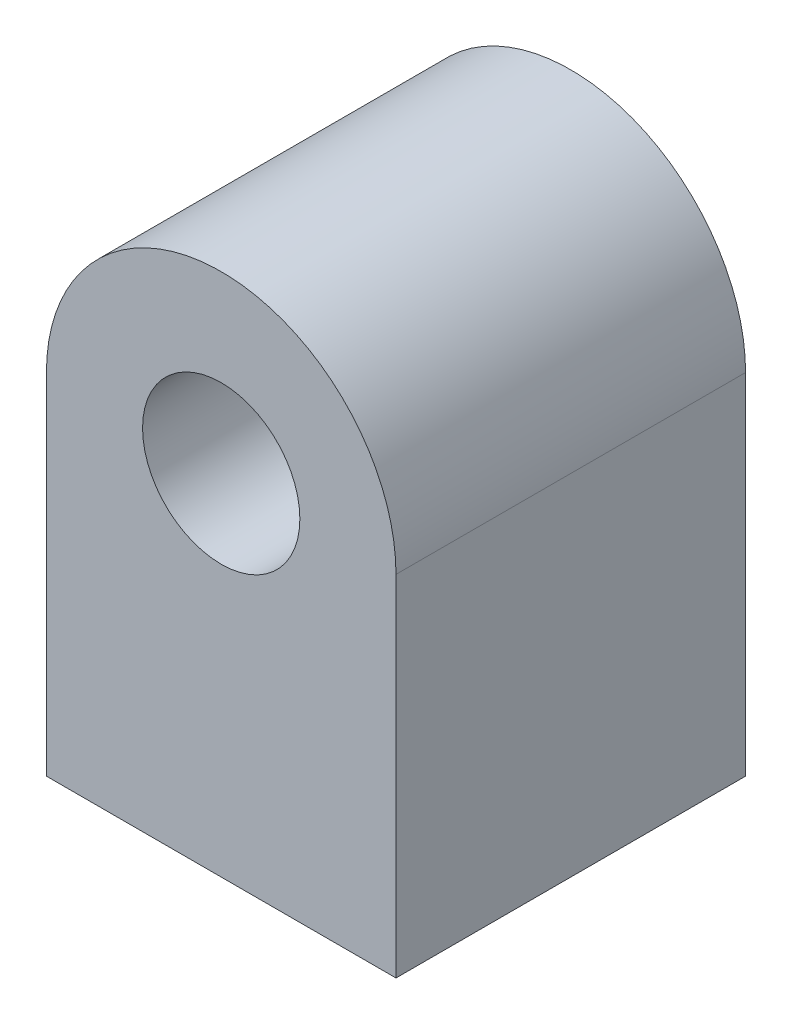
ISO-10303-21;
HEADER;
FILE_DESCRIPTION(('STEP AP214'),'2;1');
FILE_NAME('part.step','',(''),(''),'','','');
FILE_SCHEMA(('AUTOMOTIVE_DESIGN { 1 0 10303 214 1 1 1 1 }'));
ENDSEC;
DATA;
#1=APPLICATION_CONTEXT('core data for automotive mechanical design processes');
#2=APPLICATION_PROTOCOL_DEFINITION('international standard','automotive_design',2000,#1);
#3=PRODUCT_CONTEXT('',#1,'mechanical');
#4=PRODUCT('Part','Part','',(#3));
#5=PRODUCT_RELATED_PRODUCT_CATEGORY('part','',(#4));
#6=PRODUCT_DEFINITION_FORMATION('','',#4);
#7=PRODUCT_DEFINITION_CONTEXT('part definition',#1,'design');
#8=PRODUCT_DEFINITION('design','',#6,#7);
#9=PRODUCT_DEFINITION_SHAPE('','',#8);
#10=(LENGTH_UNIT() NAMED_UNIT(*) SI_UNIT(.MILLI.,.METRE.));
#11=(NAMED_UNIT(*) PLANE_ANGLE_UNIT() SI_UNIT($,.RADIAN.));
#12=(NAMED_UNIT(*) SI_UNIT($,.STERADIAN.) SOLID_ANGLE_UNIT());
#13=UNCERTAINTY_MEASURE_WITH_UNIT(LENGTH_MEASURE(1.E-05),#10,'distance_accuracy_value','');
#14=(GEOMETRIC_REPRESENTATION_CONTEXT(3) GLOBAL_UNCERTAINTY_ASSIGNED_CONTEXT((#13)) GLOBAL_UNIT_ASSIGNED_CONTEXT((#10,
#11,#12)) REPRESENTATION_CONTEXT('',''));
#15=CARTESIAN_POINT('',(0.,0.,0.));
#16=DIRECTION('',(0.,0.,1.));
#17=DIRECTION('',(1.,0.,0.));
#18=AXIS2_PLACEMENT_3D('',#15,#16,#17);
#19=CARTESIAN_POINT('',(0.,0.,20.));
#20=DIRECTION('',(1.,0.,0.));
#21=DIRECTION('',(0.,0.,-1.));
#22=AXIS2_PLACEMENT_3D('',#19,#20,#21);
#23=PLANE('',#22);
#24=DIRECTION('',(0.,-1.,0.));
#25=VECTOR('',#24,1.);
#26=CARTESIAN_POINT('',(0.,0.,0.));
#27=LINE('',#26,#25);
#28=CARTESIAN_POINT('',(0.,20.,0.));
#29=VERTEX_POINT('',#28);
#30=CARTESIAN_POINT('',(0.,0.,0.));
#31=VERTEX_POINT('',#30);
#32=EDGE_CURVE('E71',#29,#31,#27,.T.);
#33=ORIENTED_EDGE('',*,*,#32,.T.);
#34=DIRECTION('',(0.,0.,-1.));
#35=VECTOR('',#34,1.);
#36=CARTESIAN_POINT('',(0.,0.,20.));
#37=LINE('',#36,#35);
#38=CARTESIAN_POINT('',(0.,0.,20.));
#39=VERTEX_POINT('',#38);
#40=EDGE_CURVE('E11',#39,#31,#37,.T.);
#41=ORIENTED_EDGE('',*,*,#40,.F.);
#42=DIRECTION('',(0.,-1.,0.));
#43=VECTOR('',#42,1.);
#44=CARTESIAN_POINT('',(0.,0.,20.));
#45=LINE('',#44,#43);
#46=CARTESIAN_POINT('',(0.,20.,20.));
#47=VERTEX_POINT('',#46);
#48=EDGE_CURVE('E92',#47,#39,#45,.T.);
#49=ORIENTED_EDGE('',*,*,#48,.F.);
#50=DIRECTION('',(0.,0.,-1.));
#51=VECTOR('',#50,1.);
#52=CARTESIAN_POINT('',(0.,20.,20.));
#53=LINE('',#52,#51);
#54=EDGE_CURVE('E83',#47,#29,#53,.T.);
#55=ORIENTED_EDGE('',*,*,#54,.T.);
#56=EDGE_LOOP('',(#33,#41,#49,#55));
#57=FACE_BOUND('',#56,.T.);
#58=ADVANCED_FACE('F26',(#57),#23,.F.);
#59=CARTESIAN_POINT('',(0.,0.,20.));
#60=DIRECTION('',(0.,1.,0.));
#61=DIRECTION('',(0.,0.,1.));
#62=AXIS2_PLACEMENT_3D('',#59,#60,#61);
#63=PLANE('',#62);
#64=DIRECTION('',(1.,0.,0.));
#65=VECTOR('',#64,1.);
#66=CARTESIAN_POINT('',(0.,0.,0.));
#67=LINE('',#66,#65);
#68=CARTESIAN_POINT('',(20.,0.,0.));
#69=VERTEX_POINT('',#68);
#70=EDGE_CURVE('E67',#31,#69,#67,.T.);
#71=ORIENTED_EDGE('',*,*,#70,.T.);
#72=DIRECTION('',(0.,0.,-1.));
#73=VECTOR('',#72,1.);
#74=CARTESIAN_POINT('',(20.,0.,20.));
#75=LINE('',#74,#73);
#76=CARTESIAN_POINT('',(20.,0.,20.));
#77=VERTEX_POINT('',#76);
#78=EDGE_CURVE('E34',#77,#69,#75,.T.);
#79=ORIENTED_EDGE('',*,*,#78,.F.);
#80=DIRECTION('',(1.,0.,0.));
#81=VECTOR('',#80,1.);
#82=CARTESIAN_POINT('',(0.,0.,20.));
#83=LINE('',#82,#81);
#84=EDGE_CURVE('E79',#39,#77,#83,.T.);
#85=ORIENTED_EDGE('',*,*,#84,.F.);
#86=ORIENTED_EDGE('',*,*,#40,.T.);
#87=EDGE_LOOP('',(#71,#79,#85,#86));
#88=FACE_BOUND('',#87,.T.);
#89=ADVANCED_FACE('F78',(#88),#63,.F.);
#90=CARTESIAN_POINT('',(20.,0.,20.));
#91=DIRECTION('',(-1.,0.,0.));
#92=DIRECTION('',(0.,0.,1.));
#93=AXIS2_PLACEMENT_3D('',#90,#91,#92);
#94=PLANE('',#93);
#95=DIRECTION('',(0.,1.,0.));
#96=VECTOR('',#95,1.);
#97=CARTESIAN_POINT('',(20.,0.,0.));
#98=LINE('',#97,#96);
#99=CARTESIAN_POINT('',(20.,20.,0.));
#100=VERTEX_POINT('',#99);
#101=EDGE_CURVE('E72',#69,#100,#98,.T.);
#102=ORIENTED_EDGE('',*,*,#101,.T.);
#103=DIRECTION('',(0.,0.,-1.));
#104=VECTOR('',#103,1.);
#105=CARTESIAN_POINT('',(20.,20.,20.));
#106=LINE('',#105,#104);
#107=CARTESIAN_POINT('',(20.,20.,20.));
#108=VERTEX_POINT('',#107);
#109=EDGE_CURVE('E98',#108,#100,#106,.T.);
#110=ORIENTED_EDGE('',*,*,#109,.F.);
#111=DIRECTION('',(0.,1.,0.));
#112=VECTOR('',#111,1.);
#113=CARTESIAN_POINT('',(20.,0.,20.));
#114=LINE('',#113,#112);
#115=EDGE_CURVE('E46',#77,#108,#114,.T.);
#116=ORIENTED_EDGE('',*,*,#115,.F.);
#117=ORIENTED_EDGE('',*,*,#78,.T.);
#118=EDGE_LOOP('',(#102,#110,#116,#117));
#119=FACE_BOUND('',#118,.T.);
#120=ADVANCED_FACE('F102',(#119),#94,.F.);
#121=CARTESIAN_POINT('',(10.,20.,20.));
#122=DIRECTION('',(0.,0.,-1.));
#123=DIRECTION('',(-1.,0.,0.));
#124=AXIS2_PLACEMENT_3D('',#121,#122,#123);
#125=CYLINDRICAL_SURFACE('',#124,10.);
#126=CARTESIAN_POINT('',(10.,20.,0.));
#127=DIRECTION('',(0.,0.,1.));
#128=DIRECTION('',(-1.,0.,0.));
#129=AXIS2_PLACEMENT_3D('',#126,#127,#128);
#130=CIRCLE('',#129,10.);
#131=EDGE_CURVE('E90',#100,#29,#130,.T.);
#132=ORIENTED_EDGE('',*,*,#131,.T.);
#133=ORIENTED_EDGE('',*,*,#54,.F.);
#134=CARTESIAN_POINT('',(10.,20.,20.));
#135=DIRECTION('',(0.,0.,1.));
#136=DIRECTION('',(-1.,0.,0.));
#137=AXIS2_PLACEMENT_3D('',#134,#135,#136);
#138=CIRCLE('',#137,10.);
#139=EDGE_CURVE('E41',#108,#47,#138,.T.);
#140=ORIENTED_EDGE('',*,*,#139,.F.);
#141=ORIENTED_EDGE('',*,*,#109,.T.);
#142=EDGE_LOOP('',(#132,#133,#140,#141));
#143=FACE_BOUND('',#142,.T.);
#144=ADVANCED_FACE('F104',(#143),#125,.T.);
#145=CARTESIAN_POINT('',(10.,20.,20.));
#146=DIRECTION('',(0.,0.,-1.));
#147=DIRECTION('',(-1.,0.,0.));
#148=AXIS2_PLACEMENT_3D('',#145,#146,#147);
#149=PLANE('',#148);
#150=CARTESIAN_POINT('',(10.,20.,20.));
#151=DIRECTION('',(0.,0.,1.));
#152=DIRECTION('',(1.,0.,0.));
#153=AXIS2_PLACEMENT_3D('',#150,#151,#152);
#154=CIRCLE('',#153,4.5);
#155=CARTESIAN_POINT('',(14.5,20.,20.));
#156=VERTEX_POINT('',#155);
#157=EDGE_CURVE('E86',#156,#156,#154,.T.);
#158=ORIENTED_EDGE('',*,*,#157,.F.);
#159=EDGE_LOOP('',(#158));
#160=FACE_BOUND('',#159,.T.);
#161=ORIENTED_EDGE('',*,*,#48,.T.);
#162=ORIENTED_EDGE('',*,*,#84,.T.);
#163=ORIENTED_EDGE('',*,*,#115,.T.);
#164=ORIENTED_EDGE('',*,*,#139,.T.);
#165=EDGE_LOOP('',(#161,#162,#163,#164));
#166=FACE_BOUND('',#165,.T.);
#167=ADVANCED_FACE('F105',(#160,#166),#149,.F.);
#168=CARTESIAN_POINT('',(10.,20.,0.));
#169=DIRECTION('',(0.,0.,-1.));
#170=DIRECTION('',(-1.,0.,0.));
#171=AXIS2_PLACEMENT_3D('',#168,#169,#170);
#172=PLANE('',#171);
#173=CARTESIAN_POINT('',(10.,20.,0.));
#174=DIRECTION('',(0.,0.,-1.));
#175=DIRECTION('',(-1.,0.,0.));
#176=AXIS2_PLACEMENT_3D('',#173,#174,#175);
#177=CIRCLE('',#176,4.5);
#178=CARTESIAN_POINT('',(5.5,20.,0.));
#179=VERTEX_POINT('',#178);
#180=EDGE_CURVE('E29',#179,#179,#177,.T.);
#181=ORIENTED_EDGE('',*,*,#180,.F.);
#182=EDGE_LOOP('',(#181));
#183=FACE_BOUND('',#182,.T.);
#184=ORIENTED_EDGE('',*,*,#32,.F.);
#185=ORIENTED_EDGE('',*,*,#131,.F.);
#186=ORIENTED_EDGE('',*,*,#101,.F.);
#187=ORIENTED_EDGE('',*,*,#70,.F.);
#188=EDGE_LOOP('',(#184,#185,#186,#187));
#189=FACE_BOUND('',#188,.T.);
#190=ADVANCED_FACE('F68',(#183,#189),#172,.T.);
#191=CARTESIAN_POINT('',(10.,20.,20.));
#192=DIRECTION('',(0.,0.,1.));
#193=DIRECTION('',(1.,0.,0.));
#194=AXIS2_PLACEMENT_3D('',#191,#192,#193);
#195=CYLINDRICAL_SURFACE('',#194,4.5);
#196=ORIENTED_EDGE('',*,*,#180,.T.);
#197=EDGE_LOOP('',(#196));
#198=FACE_BOUND('',#197,.T.);
#199=ORIENTED_EDGE('',*,*,#157,.T.);
#200=EDGE_LOOP('',(#199));
#201=FACE_BOUND('',#200,.T.);
#202=ADVANCED_FACE('F113',(#198,#201),#195,.F.);
#203=CLOSED_SHELL('',(#58,#89,#120,#144,#167,#190,#202));
#204=MANIFOLD_SOLID_BREP('B2',#203);
#205=ADVANCED_BREP_SHAPE_REPRESENTATION('',(#18,#204),#14);
#206=SHAPE_DEFINITION_REPRESENTATION(#9,#205);
ENDSEC;
END-ISO-10303-21;
